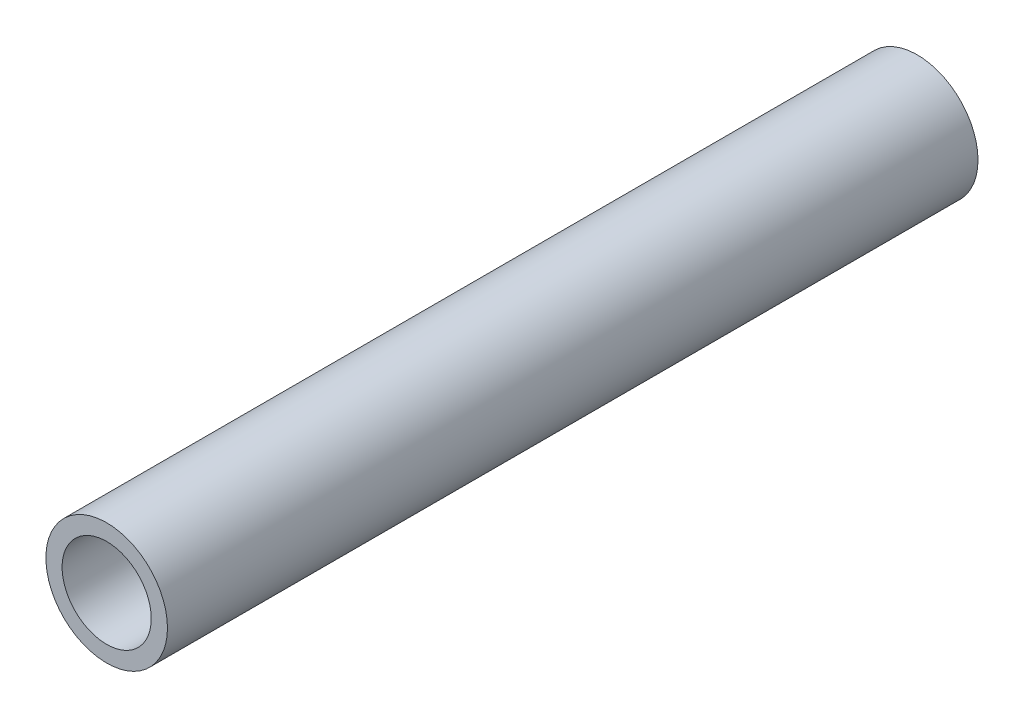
ISO-10303-21;
HEADER;
FILE_DESCRIPTION(('STEP AP214'),'2;1');
FILE_NAME('part.step','',(''),(''),'','','');
FILE_SCHEMA(('AUTOMOTIVE_DESIGN { 1 0 10303 214 1 1 1 1 }'));
ENDSEC;
DATA;
#1=APPLICATION_CONTEXT('core data for automotive mechanical design processes');
#2=APPLICATION_PROTOCOL_DEFINITION('international standard','automotive_design',2000,#1);
#3=PRODUCT_CONTEXT('',#1,'mechanical');
#4=PRODUCT('Part','Part','',(#3));
#5=PRODUCT_RELATED_PRODUCT_CATEGORY('part','',(#4));
#6=PRODUCT_DEFINITION_FORMATION('','',#4);
#7=PRODUCT_DEFINITION_CONTEXT('part definition',#1,'design');
#8=PRODUCT_DEFINITION('design','',#6,#7);
#9=PRODUCT_DEFINITION_SHAPE('','',#8);
#10=(LENGTH_UNIT() NAMED_UNIT(*) SI_UNIT(.MILLI.,.METRE.));
#11=(NAMED_UNIT(*) PLANE_ANGLE_UNIT() SI_UNIT($,.RADIAN.));
#12=(NAMED_UNIT(*) SI_UNIT($,.STERADIAN.) SOLID_ANGLE_UNIT());
#13=UNCERTAINTY_MEASURE_WITH_UNIT(LENGTH_MEASURE(1.E-05),#10,'distance_accuracy_value','');
#14=(GEOMETRIC_REPRESENTATION_CONTEXT(3) GLOBAL_UNCERTAINTY_ASSIGNED_CONTEXT((#13)) GLOBAL_UNIT_ASSIGNED_CONTEXT((#10,
#11,#12)) REPRESENTATION_CONTEXT('',''));
#15=CARTESIAN_POINT('',(0.,0.,0.));
#16=DIRECTION('',(0.,0.,1.));
#17=DIRECTION('',(1.,0.,0.));
#18=AXIS2_PLACEMENT_3D('',#15,#16,#17);
#19=CARTESIAN_POINT('',(25.4000000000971,-101.600000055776,127.));
#20=DIRECTION('',(0.,0.,-1.));
#21=DIRECTION('',(-1.,0.,0.));
#22=AXIS2_PLACEMENT_3D('',#19,#20,#21);
#23=CYLINDRICAL_SURFACE('',#22,6.98499999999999);
#24=CARTESIAN_POINT('',(25.4000000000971,-101.600000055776,127.));
#25=DIRECTION('',(0.,0.,1.));
#26=DIRECTION('',(1.,0.,0.));
#27=AXIS2_PLACEMENT_3D('',#24,#25,#26);
#28=CIRCLE('',#27,6.98499999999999);
#29=CARTESIAN_POINT('',(32.3850000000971,-101.600000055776,127.));
#30=VERTEX_POINT('',#29);
#31=EDGE_CURVE('E52',#30,#30,#28,.T.);
#32=ORIENTED_EDGE('',*,*,#31,.T.);
#33=EDGE_LOOP('',(#32));
#34=FACE_BOUND('',#33,.T.);
#35=CARTESIAN_POINT('',(25.4000000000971,-101.600000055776,0.));
#36=DIRECTION('',(0.,0.,1.));
#37=DIRECTION('',(1.,0.,0.));
#38=AXIS2_PLACEMENT_3D('',#35,#36,#37);
#39=CIRCLE('',#38,6.98499999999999);
#40=CARTESIAN_POINT('',(32.3850000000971,-101.600000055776,0.));
#41=VERTEX_POINT('',#40);
#42=EDGE_CURVE('E58',#41,#41,#39,.T.);
#43=ORIENTED_EDGE('',*,*,#42,.F.);
#44=EDGE_LOOP('',(#43));
#45=FACE_BOUND('',#44,.T.);
#46=ADVANCED_FACE('F45',(#34,#45),#23,.F.);
#47=CARTESIAN_POINT('',(25.4000000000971,-101.600000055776,127.));
#48=DIRECTION('',(0.,0.,-1.));
#49=DIRECTION('',(-1.,0.,0.));
#50=AXIS2_PLACEMENT_3D('',#47,#48,#49);
#51=CYLINDRICAL_SURFACE('',#50,9.525);
#52=CARTESIAN_POINT('',(25.4000000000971,-101.600000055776,127.));
#53=DIRECTION('',(0.,0.,1.));
#54=DIRECTION('',(1.,0.,0.));
#55=AXIS2_PLACEMENT_3D('',#52,#53,#54);
#56=CIRCLE('',#55,9.525);
#57=CARTESIAN_POINT('',(34.9250000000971,-101.600000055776,127.));
#58=VERTEX_POINT('',#57);
#59=EDGE_CURVE('E10',#58,#58,#56,.T.);
#60=ORIENTED_EDGE('',*,*,#59,.F.);
#61=EDGE_LOOP('',(#60));
#62=FACE_BOUND('',#61,.T.);
#63=CARTESIAN_POINT('',(25.4000000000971,-101.600000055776,0.));
#64=DIRECTION('',(0.,0.,1.));
#65=DIRECTION('',(1.,0.,0.));
#66=AXIS2_PLACEMENT_3D('',#63,#64,#65);
#67=CIRCLE('',#66,9.525);
#68=CARTESIAN_POINT('',(34.9250000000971,-101.600000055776,0.));
#69=VERTEX_POINT('',#68);
#70=EDGE_CURVE('E48',#69,#69,#67,.T.);
#71=ORIENTED_EDGE('',*,*,#70,.T.);
#72=EDGE_LOOP('',(#71));
#73=FACE_BOUND('',#72,.T.);
#74=ADVANCED_FACE('F65',(#62,#73),#51,.T.);
#75=CARTESIAN_POINT('',(0.,0.,127.));
#76=DIRECTION('',(0.,0.,1.));
#77=DIRECTION('',(1.,0.,0.));
#78=AXIS2_PLACEMENT_3D('',#75,#76,#77);
#79=PLANE('',#78);
#80=ORIENTED_EDGE('',*,*,#31,.F.);
#81=EDGE_LOOP('',(#80));
#82=FACE_BOUND('',#81,.T.);
#83=ORIENTED_EDGE('',*,*,#59,.T.);
#84=EDGE_LOOP('',(#83));
#85=FACE_BOUND('',#84,.T.);
#86=ADVANCED_FACE('F69',(#82,#85),#79,.T.);
#87=CARTESIAN_POINT('',(0.,0.,0.));
#88=DIRECTION('',(0.,0.,1.));
#89=DIRECTION('',(1.,0.,0.));
#90=AXIS2_PLACEMENT_3D('',#87,#88,#89);
#91=PLANE('',#90);
#92=ORIENTED_EDGE('',*,*,#42,.T.);
#93=EDGE_LOOP('',(#92));
#94=FACE_BOUND('',#93,.T.);
#95=ORIENTED_EDGE('',*,*,#70,.F.);
#96=EDGE_LOOP('',(#95));
#97=FACE_BOUND('',#96,.T.);
#98=ADVANCED_FACE('F67',(#94,#97),#91,.F.);
#99=CLOSED_SHELL('',(#46,#74,#86,#98));
#100=MANIFOLD_SOLID_BREP('B2',#99);
#101=ADVANCED_BREP_SHAPE_REPRESENTATION('',(#18,#100),#14);
#102=SHAPE_DEFINITION_REPRESENTATION(#9,#101);
ENDSEC;
END-ISO-10303-21;
